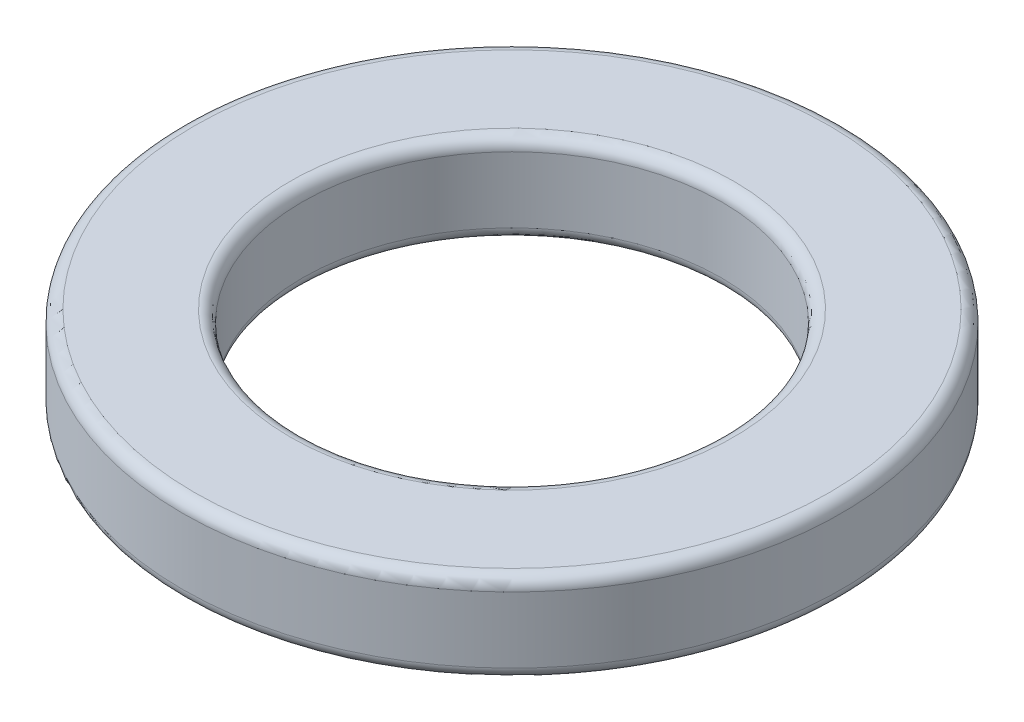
ISO-10303-21;
HEADER;
FILE_DESCRIPTION(('STEP AP214'),'2;1');
FILE_NAME('part.step','',(''),(''),'','','');
FILE_SCHEMA(('AUTOMOTIVE_DESIGN { 1 0 10303 214 1 1 1 1 }'));
ENDSEC;
DATA;
#1=APPLICATION_CONTEXT('core data for automotive mechanical design processes');
#2=APPLICATION_PROTOCOL_DEFINITION('international standard','automotive_design',2000,#1);
#3=PRODUCT_CONTEXT('',#1,'mechanical');
#4=PRODUCT('Part','Part','',(#3));
#5=PRODUCT_RELATED_PRODUCT_CATEGORY('part','',(#4));
#6=PRODUCT_DEFINITION_FORMATION('','',#4);
#7=PRODUCT_DEFINITION_CONTEXT('part definition',#1,'design');
#8=PRODUCT_DEFINITION('design','',#6,#7);
#9=PRODUCT_DEFINITION_SHAPE('','',#8);
#10=(LENGTH_UNIT() NAMED_UNIT(*) SI_UNIT(.MILLI.,.METRE.));
#11=(NAMED_UNIT(*) PLANE_ANGLE_UNIT() SI_UNIT($,.RADIAN.));
#12=(NAMED_UNIT(*) SI_UNIT($,.STERADIAN.) SOLID_ANGLE_UNIT());
#13=UNCERTAINTY_MEASURE_WITH_UNIT(LENGTH_MEASURE(1.E-05),#10,'distance_accuracy_value','');
#14=(GEOMETRIC_REPRESENTATION_CONTEXT(3) GLOBAL_UNCERTAINTY_ASSIGNED_CONTEXT((#13)) GLOBAL_UNIT_ASSIGNED_CONTEXT((#10,
#11,#12)) REPRESENTATION_CONTEXT('',''));
#15=CARTESIAN_POINT('',(0.,0.,0.));
#16=DIRECTION('',(0.,0.,1.));
#17=DIRECTION('',(1.,0.,0.));
#18=AXIS2_PLACEMENT_3D('',#15,#16,#17);
#19=CARTESIAN_POINT('',(0.,15.7889265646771,0.));
#20=DIRECTION('',(0.,1.,0.));
#21=DIRECTION('',(0.,0.,1.));
#22=AXIS2_PLACEMENT_3D('',#19,#20,#21);
#23=CYLINDRICAL_SURFACE('',#22,7.);
#24=CARTESIAN_POINT('',(0.,2.6,0.));
#25=DIRECTION('',(0.,-1.,0.));
#26=DIRECTION('',(0.,0.,-1.));
#27=AXIS2_PLACEMENT_3D('',#24,#25,#26);
#28=CIRCLE('',#27,7.);
#29=CARTESIAN_POINT('',(0.,2.6,-7.));
#30=VERTEX_POINT('',#29);
#31=EDGE_CURVE('E54',#30,#30,#28,.F.);
#32=ORIENTED_EDGE('',*,*,#31,.T.);
#33=EDGE_LOOP('',(#32));
#34=FACE_BOUND('',#33,.T.);
#35=CARTESIAN_POINT('',(0.,0.399999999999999,0.));
#36=DIRECTION('',(0.,1.,0.));
#37=DIRECTION('',(0.,0.,1.));
#38=AXIS2_PLACEMENT_3D('',#35,#36,#37);
#39=CIRCLE('',#38,7.);
#40=CARTESIAN_POINT('',(0.,0.399999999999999,7.));
#41=VERTEX_POINT('',#40);
#42=EDGE_CURVE('E57',#41,#41,#39,.F.);
#43=ORIENTED_EDGE('',*,*,#42,.T.);
#44=EDGE_LOOP('',(#43));
#45=FACE_BOUND('',#44,.T.);
#46=ADVANCED_FACE('F29',(#34,#45),#23,.F.);
#47=CARTESIAN_POINT('',(7.,3.,0.));
#48=DIRECTION('',(0.,-1.,0.));
#49=DIRECTION('',(0.,0.,-1.));
#50=AXIS2_PLACEMENT_3D('',#47,#48,#49);
#51=PLANE('',#50);
#52=CARTESIAN_POINT('',(0.,3.,0.));
#53=DIRECTION('',(0.,-1.,0.));
#54=DIRECTION('',(0.,0.,-1.));
#55=AXIS2_PLACEMENT_3D('',#52,#53,#54);
#56=CIRCLE('',#55,7.4);
#57=CARTESIAN_POINT('',(0.,3.,-7.4));
#58=VERTEX_POINT('',#57);
#59=EDGE_CURVE('E48',#58,#58,#56,.T.);
#60=ORIENTED_EDGE('',*,*,#59,.T.);
#61=EDGE_LOOP('',(#60));
#62=FACE_BOUND('',#61,.T.);
#63=CARTESIAN_POINT('',(0.,3.,0.));
#64=DIRECTION('',(0.,-1.,0.));
#65=DIRECTION('',(0.,0.,-1.));
#66=AXIS2_PLACEMENT_3D('',#63,#64,#65);
#67=CIRCLE('',#66,10.6);
#68=CARTESIAN_POINT('',(0.,3.,-10.6));
#69=VERTEX_POINT('',#68);
#70=EDGE_CURVE('E51',#69,#69,#67,.F.);
#71=ORIENTED_EDGE('',*,*,#70,.T.);
#72=EDGE_LOOP('',(#71));
#73=FACE_BOUND('',#72,.T.);
#74=ADVANCED_FACE('F87',(#62,#73),#51,.F.);
#75=CARTESIAN_POINT('',(0.,15.7889265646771,0.));
#76=DIRECTION('',(0.,1.,0.));
#77=DIRECTION('',(0.,0.,1.));
#78=AXIS2_PLACEMENT_3D('',#75,#76,#77);
#79=CYLINDRICAL_SURFACE('',#78,11.);
#80=CARTESIAN_POINT('',(0.,0.399999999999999,0.));
#81=DIRECTION('',(0.,1.,0.));
#82=DIRECTION('',(0.,0.,1.));
#83=AXIS2_PLACEMENT_3D('',#80,#81,#82);
#84=CIRCLE('',#83,11.);
#85=CARTESIAN_POINT('',(0.,0.399999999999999,11.));
#86=VERTEX_POINT('',#85);
#87=EDGE_CURVE('E10',#86,#86,#84,.T.);
#88=ORIENTED_EDGE('',*,*,#87,.T.);
#89=EDGE_LOOP('',(#88));
#90=FACE_BOUND('',#89,.T.);
#91=CARTESIAN_POINT('',(0.,2.6,0.));
#92=DIRECTION('',(0.,-1.,0.));
#93=DIRECTION('',(0.,0.,-1.));
#94=AXIS2_PLACEMENT_3D('',#91,#92,#93);
#95=CIRCLE('',#94,11.);
#96=CARTESIAN_POINT('',(0.,2.6,-11.));
#97=VERTEX_POINT('',#96);
#98=EDGE_CURVE('E35',#97,#97,#95,.T.);
#99=ORIENTED_EDGE('',*,*,#98,.T.);
#100=EDGE_LOOP('',(#99));
#101=FACE_BOUND('',#100,.T.);
#102=ADVANCED_FACE('F73',(#90,#101),#79,.T.);
#103=CARTESIAN_POINT('',(7.,0.,0.));
#104=DIRECTION('',(0.,1.,0.));
#105=DIRECTION('',(0.,0.,1.));
#106=AXIS2_PLACEMENT_3D('',#103,#104,#105);
#107=PLANE('',#106);
#108=CARTESIAN_POINT('',(0.,0.,0.));
#109=DIRECTION('',(0.,1.,0.));
#110=DIRECTION('',(0.,0.,1.));
#111=AXIS2_PLACEMENT_3D('',#108,#109,#110);
#112=CIRCLE('',#111,7.4);
#113=CARTESIAN_POINT('',(0.,0.,7.4));
#114=VERTEX_POINT('',#113);
#115=EDGE_CURVE('E39',#114,#114,#112,.T.);
#116=ORIENTED_EDGE('',*,*,#115,.T.);
#117=EDGE_LOOP('',(#116));
#118=FACE_BOUND('',#117,.T.);
#119=CARTESIAN_POINT('',(0.,0.,0.));
#120=DIRECTION('',(0.,1.,0.));
#121=DIRECTION('',(0.,0.,1.));
#122=AXIS2_PLACEMENT_3D('',#119,#120,#121);
#123=CIRCLE('',#122,10.6);
#124=CARTESIAN_POINT('',(0.,0.,10.6));
#125=VERTEX_POINT('',#124);
#126=EDGE_CURVE('E43',#125,#125,#123,.F.);
#127=ORIENTED_EDGE('',*,*,#126,.T.);
#128=EDGE_LOOP('',(#127));
#129=FACE_BOUND('',#128,.T.);
#130=ADVANCED_FACE('F70',(#118,#129),#107,.F.);
#131=CARTESIAN_POINT('',(0.,2.6,0.));
#132=DIRECTION('',(0.,-1.,0.));
#133=DIRECTION('',(0.,0.,-1.));
#134=AXIS2_PLACEMENT_3D('',#131,#132,#133);
#135=TOROIDAL_SURFACE('',#134,7.4,0.4);
#136=ORIENTED_EDGE('',*,*,#59,.F.);
#137=EDGE_LOOP('',(#136));
#138=FACE_BOUND('',#137,.T.);
#139=ORIENTED_EDGE('',*,*,#31,.F.);
#140=EDGE_LOOP('',(#139));
#141=FACE_BOUND('',#140,.T.);
#142=ADVANCED_FACE('F66',(#138,#141),#135,.T.);
#143=CARTESIAN_POINT('',(0.,0.399999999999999,0.));
#144=DIRECTION('',(0.,1.,0.));
#145=DIRECTION('',(0.,0.,1.));
#146=AXIS2_PLACEMENT_3D('',#143,#144,#145);
#147=TOROIDAL_SURFACE('',#146,7.4,0.4);
#148=ORIENTED_EDGE('',*,*,#42,.F.);
#149=EDGE_LOOP('',(#148));
#150=FACE_BOUND('',#149,.T.);
#151=ORIENTED_EDGE('',*,*,#115,.F.);
#152=EDGE_LOOP('',(#151));
#153=FACE_BOUND('',#152,.T.);
#154=ADVANCED_FACE('F62',(#150,#153),#147,.T.);
#155=CARTESIAN_POINT('',(0.,0.399999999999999,0.));
#156=DIRECTION('',(0.,1.,0.));
#157=DIRECTION('',(0.,0.,1.));
#158=AXIS2_PLACEMENT_3D('',#155,#156,#157);
#159=TOROIDAL_SURFACE('',#158,10.6,0.4);
#160=ORIENTED_EDGE('',*,*,#126,.F.);
#161=EDGE_LOOP('',(#160));
#162=FACE_BOUND('',#161,.T.);
#163=ORIENTED_EDGE('',*,*,#87,.F.);
#164=EDGE_LOOP('',(#163));
#165=FACE_BOUND('',#164,.T.);
#166=ADVANCED_FACE('F65',(#162,#165),#159,.T.);
#167=CARTESIAN_POINT('',(0.,2.6,0.));
#168=DIRECTION('',(0.,-1.,0.));
#169=DIRECTION('',(0.,0.,-1.));
#170=AXIS2_PLACEMENT_3D('',#167,#168,#169);
#171=TOROIDAL_SURFACE('',#170,10.6,0.4);
#172=ORIENTED_EDGE('',*,*,#98,.F.);
#173=EDGE_LOOP('',(#172));
#174=FACE_BOUND('',#173,.T.);
#175=ORIENTED_EDGE('',*,*,#70,.F.);
#176=EDGE_LOOP('',(#175));
#177=FACE_BOUND('',#176,.T.);
#178=ADVANCED_FACE('F79',(#174,#177),#171,.T.);
#179=CLOSED_SHELL('',(#46,#74,#102,#130,#142,#154,#166,#178));
#180=MANIFOLD_SOLID_BREP('B2',#179);
#181=ADVANCED_BREP_SHAPE_REPRESENTATION('',(#18,#180),#14);
#182=SHAPE_DEFINITION_REPRESENTATION(#9,#181);
ENDSEC;
END-ISO-10303-21;
